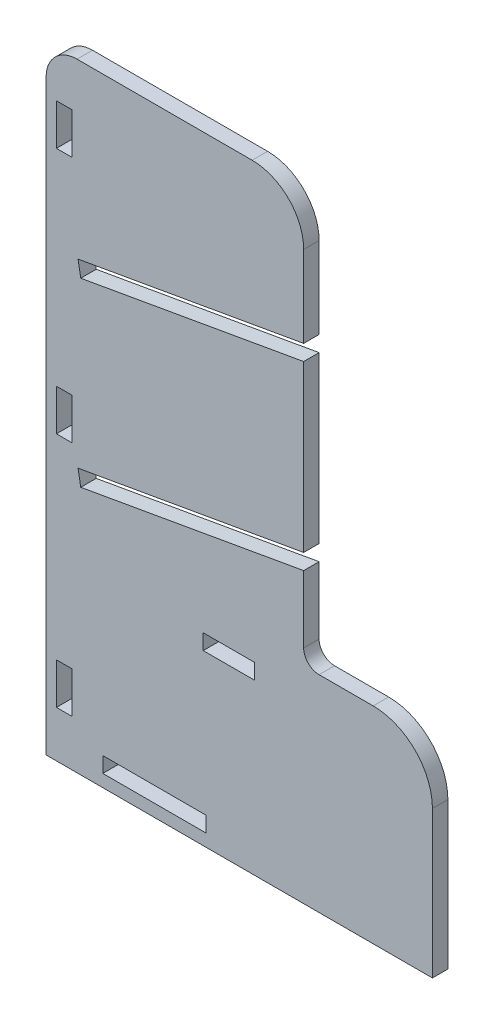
from build123d import *

# Parameters (mm, degrees)
SALIENTE_EXTRUIR1_DEPTH    = 15
CORTAR_EXTRUIR2_REACH      = 392.8
CROQUIS3_W                 = 15
CROQUIS3_H                 = 40
CORTAR_EXTRUIR3_REACH      = 392.8
CROQUIS4_W                 = 50
CROQUIS4_H                 = 15
CORTAR_EXTRUIR4_REACH      = 392.8
CROQUIS6_W                 = 100
CROQUIS6_H                 = 15
CORTAR_EXTRUIR5_DEPTH      = 391.800460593
CORTAR_EXTRUIR5_DEPTH_BACK = 781


with BuildPart() as part:
    # Croquis1 → Saliente-Extruir1 (new body)
    with BuildSketch(Plane.XY):
        with BuildLine():
            Line((-125, 270), (-125, -300))
            Line((-125, -300), (250, -300))
            Line((250, -300), (250, -157.5))
            ThreePointArc((250, -157.5), (233.158639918, -116.841360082), (192.5, -100))
            Line((192.5, -100), (140, -100))
            ThreePointArc((140, -100), (129.393398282, -95.606601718), (125, -85))
            Line((125, -85), (125, 250))
            ThreePointArc((125, 250), (110.355339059, 285.355339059), (75, 300))
            Line((75, 300), (-95, 300))
            ThreePointArc((-95, 300), (-116.213203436, 291.213203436), (-125, 270))
        make_face()
    extrude(amount=SALIENTE_EXTRUIR1_DEPTH)

    # Croquis3 → Cortar-Extruir2 (cut, up to next)
    with BuildSketch(Plane.XY.offset(15), mode=Mode.PRIVATE) as cortar_extruir2_sk1:
        with Locations((-107.5, 235)):
            Rectangle(CROQUIS3_W, CROQUIS3_H)
    cortar_extruir2_tool1 = extrude(cortar_extruir2_sk1.sketch, amount=-CORTAR_EXTRUIR2_REACH, mode=Mode.PRIVATE) & part.part
    # Croquis3 → Cortar-Extruir2 (cut, up to next)
    with BuildSketch(Plane.XY.offset(15), mode=Mode.PRIVATE) as cortar_extruir2_sk2:
        with Locations((-107.5, -235)):
            Rectangle(CROQUIS3_W, CROQUIS3_H)
    cortar_extruir2_tool2 = extrude(cortar_extruir2_sk2.sketch, amount=-CORTAR_EXTRUIR2_REACH, mode=Mode.PRIVATE) & part.part
    # Croquis3 → Cortar-Extruir2 (cut, up to next)
    with BuildSketch(Plane.XY.offset(15), mode=Mode.PRIVATE) as cortar_extruir2_sk3:
        with Locations((-107.5, -5)):
            Rectangle(CROQUIS3_W, CROQUIS3_H)
    cortar_extruir2_tool3 = extrude(cortar_extruir2_sk3.sketch, amount=-CORTAR_EXTRUIR2_REACH, mode=Mode.PRIVATE) & part.part
    add(cortar_extruir2_tool1.solids().sort_by_distance((-107.5, 235, 15))[0], mode=Mode.SUBTRACT)
    add(cortar_extruir2_tool2.solids().sort_by_distance((-107.5, -235, 15))[0], mode=Mode.SUBTRACT)
    add(cortar_extruir2_tool3.solids().sort_by_distance((-107.5, -5, 15))[0], mode=Mode.SUBTRACT)

    # Croquis4 → Cortar-Extruir3 (cut, up to next)
    with BuildSketch(Plane.XY.offset(15), mode=Mode.PRIVATE) as cortar_extruir3_sk1:
        with Locations((52.5, -128.5)):
            Rectangle(CROQUIS4_W, CROQUIS4_H)
    cortar_extruir3_tool1 = extrude(cortar_extruir3_sk1.sketch, amount=-CORTAR_EXTRUIR3_REACH, mode=Mode.PRIVATE) & part.part
    add(cortar_extruir3_tool1.solids().sort_by_distance((52.5, -128.5, 15))[0], mode=Mode.SUBTRACT)

    # Croquis6 → Cortar-Extruir4 (cut, up to next)
    with BuildSketch(Plane.XY.offset(15), mode=Mode.PRIVATE) as cortar_extruir4_sk1:
        with Locations((-20, -280.5)):
            Rectangle(CROQUIS6_W, CROQUIS6_H)
    cortar_extruir4_tool1 = extrude(cortar_extruir4_sk1.sketch, amount=-CORTAR_EXTRUIR4_REACH, mode=Mode.PRIVATE) & part.part
    add(cortar_extruir4_tool1.solids().sort_by_distance((-20, -280.5, 15))[0], mode=Mode.SUBTRACT)

    # Croquis7 → Cortar-Extruir5 (cut, two sides: drawn at the far end of the back side and taken through both)
    with BuildSketch(Plane.XY.offset(15).offset(-CORTAR_EXTRUIR5_DEPTH_BACK)):
        Polygon((125, 171), (-94, 132.384391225), (-91.395277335, 117.61227493), (125, 155.768600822), align=None)
        Polygon((125, -4.768600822), (-94, -43.384209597), (-91.395277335, -58.156325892), (125, -20), align=None)
    extrude(amount=CORTAR_EXTRUIR5_DEPTH + CORTAR_EXTRUIR5_DEPTH_BACK, mode=Mode.SUBTRACT)


solid = part.part
